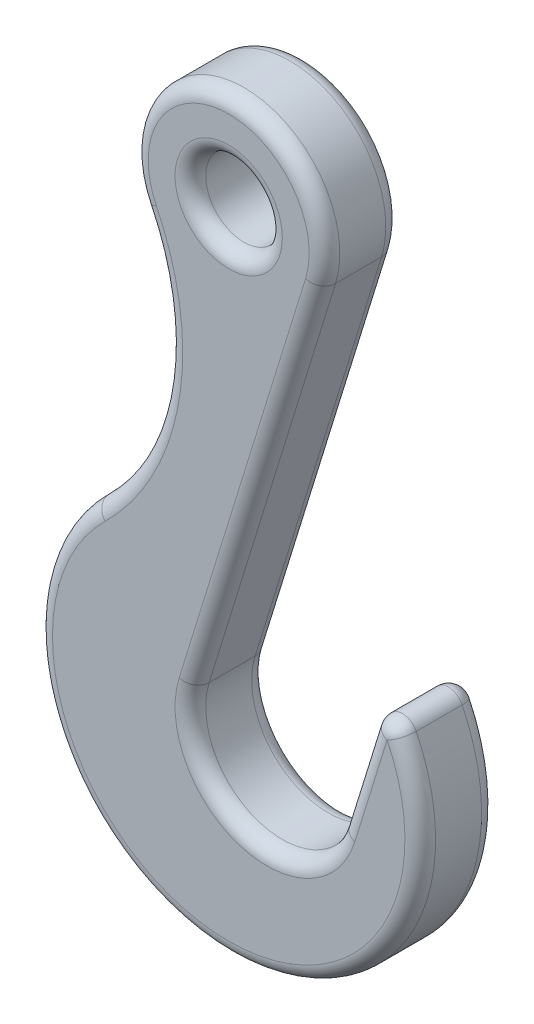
from build123d import *

# Parameters (mm, degrees)
EXTRUDE_1_DEPTH     = 10
SKETCH_4_R          = 5
CUT_EXTRUDE_1_DEPTH = 78.338541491
FILLET_1_R          = 2
FILLET_2_R          = 2


with BuildPart() as part:
    # Sketch 3 → Extrude 1 (new body)
    with BuildSketch(Plane.XY):
        with BuildLine():
            Line((11.942228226, 56.307685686), (-4.553782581, 2.953851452))
            ThreePointArc((-4.553782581, 2.953851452), (2.046148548, -9.553782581), (14.553782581, -2.953851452))
            Line((14.553782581, -2.953851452), (20.074081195, 14.900713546))
            ThreePointArc((20.074081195, 14.900713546), (-1.943226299, -24.924363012), (-17.522085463, 17.831896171))
            ThreePointArc((-17.522085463, 17.831896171), (-8.458087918, 35.15728691), (-11.231222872, 54.512775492))
            ThreePointArc((-11.231222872, 54.512775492), (-0.965301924, 72.462671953), (11.942228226, 56.307685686))
        make_face()
    extrude(amount=EXTRUDE_1_DEPTH)

    # Sketch 4 → Cut-Extrude 1 (cut, through all)
    with BuildSketch(Plane.XY):
        with Locations((0, 60)):
            Circle(SKETCH_4_R)
    extrude(amount=CUT_EXTRUDE_1_DEPTH, mode=Mode.SUBTRACT)

    # Fillet 1
    fillet_1_edges = [part.edges().sort_by_distance(p)[0] for p in [
        (20.074081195, 14.900713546, 5),
    ]]
    fillet(fillet_1_edges, radius=FILLET_1_R)

    # Fillet 2
    fillet_2_edges = [part.edges().sort_by_distance(p)[0] for p in [
        (-4.238326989, -24.638112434, 10),
        (2.046148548, -9.553782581, 10),
        (3.694222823, 29.630768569, 10),
        (-5, 60, 0),
        (-5, 60, 10),
        (16.65933937, 3.856251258, 0),
        (16.65933937, 3.856251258, 10),
        (20.522212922, 12.069689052, 0),
        (20.522212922, 12.069689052, 10),
        (-0.965301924, 72.462671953, 10),
        (3.694222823, 29.630768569, 0),
        (2.046148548, -9.553782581, 0),
        (-8.458087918, 35.15728691, 10),
        (-4.238326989, -24.638112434, 0),
        (-8.458087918, 35.15728691, 0),
        (-0.965301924, 72.462671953, 0),
    ]]
    fillet(fillet_2_edges, radius=FILLET_2_R)


solid = part.part
